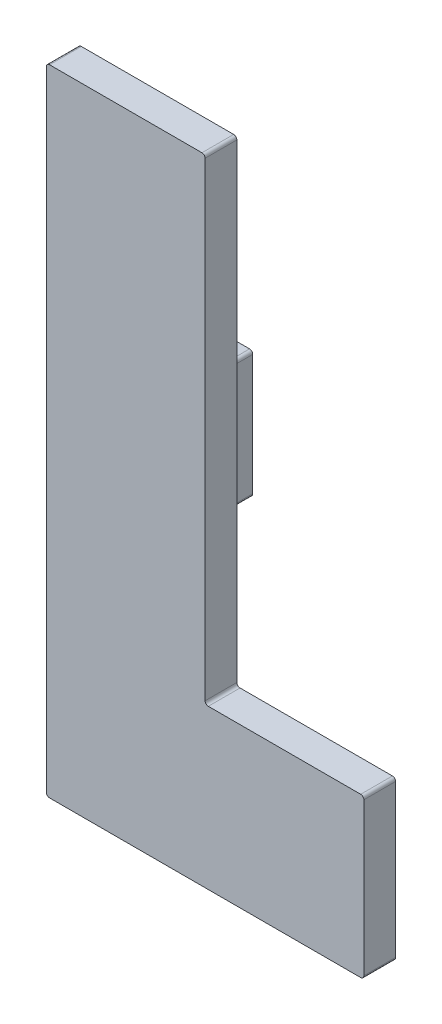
from build123d import *

# Parameters (mm, degrees)
AUFSATZ_LINEAR_AUSTRAGEN1_DEPTH = 5
SCHNITT_LINEAR_START            = 0.8
SKIZZE3_R                       = 2.7
SCHNITT_LINEAR_AUSTRAGEN1_DEPTH = 2.9
VERRUNDUNG1_R                   = 0.5
SKIZZE4_W                       = 6
SKIZZE4_H                       = 20
AUFSATZ_LINEAR_AUSTRAGEN2_DEPTH = 12
VERRUNDUNG2_R                   = 1.5
VERRUNDUNG3_R                   = 0.5


with BuildPart() as part:
    # Skizze1 → Aufsatz-Linear austragen1 (new body)
    with BuildSketch(Plane.XY):
        Polygon((0, 0), (50, 0), (50, 25), (25, 25), (25, 100), (0, 100), align=None)
    extrude(amount=AUFSATZ_LINEAR_AUSTRAGEN1_DEPTH)

    # Skizze3 → Schnitt-Linear austragen1 (cut)
    with BuildSketch(Plane(origin=(0, 0, 5), x_dir=(-1, 0, 0), z_dir=(0, 0, -1)).offset(SCHNITT_LINEAR_START)):
        with Locations((-12.5, 87.5)):
            Circle(SKIZZE3_R)
    extrude(amount=SCHNITT_LINEAR_AUSTRAGEN1_DEPTH, mode=Mode.SUBTRACT)

    # Verrundung1
    verrundung1_edges = [part.edges().sort_by_distance(p)[0] for p in [
        (0, 100, 2.5),
        (25, 100, 2.5),
        (25, 25, 2.5),
        (50, 25, 2.5),
        (50, 0, 2.5),
        (0, 0, 2.5),
    ]]
    fillet(verrundung1_edges, radius=VERRUNDUNG1_R)

    # Skizze4 → Aufsatz-Linear austragen2 (add)
    with BuildSketch(Plane(origin=(0, 0, 0), x_dir=(-1, 0, 0), z_dir=(0, 0, -1))):
        with Locations((-12.5, 50)):
            Rectangle(SKIZZE4_W, SKIZZE4_H)
    extrude(amount=AUFSATZ_LINEAR_AUSTRAGEN2_DEPTH)

    # Verrundung2
    verrundung2_edges = [part.edges().sort_by_distance(p)[0] for p in [
        (15.5, 50, 0),
        (12.5, 40, 0),
        (9.5, 50, 0),
        (12.5, 60, 0),
    ]]
    fillet(verrundung2_edges, radius=VERRUNDUNG2_R)

    # Verrundung3
    verrundung3_edges = [part.edges().sort_by_distance(p)[0] for p in [
        (15.5, 60, -6.75),
        (15.5, 40, -6.75),
        (9.5, 40, -6.75),
        (9.5, 60, -6.75),
        (8.969073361, 39.469073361, -0.355055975),
        (16.030926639, 39.469073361, -0.355055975),
        (8.969073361, 60.530926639, -0.355055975),
        (16.030926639, 60.530926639, -0.355055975),
    ]]
    fillet(verrundung3_edges, radius=VERRUNDUNG3_R)


solid = part.part
